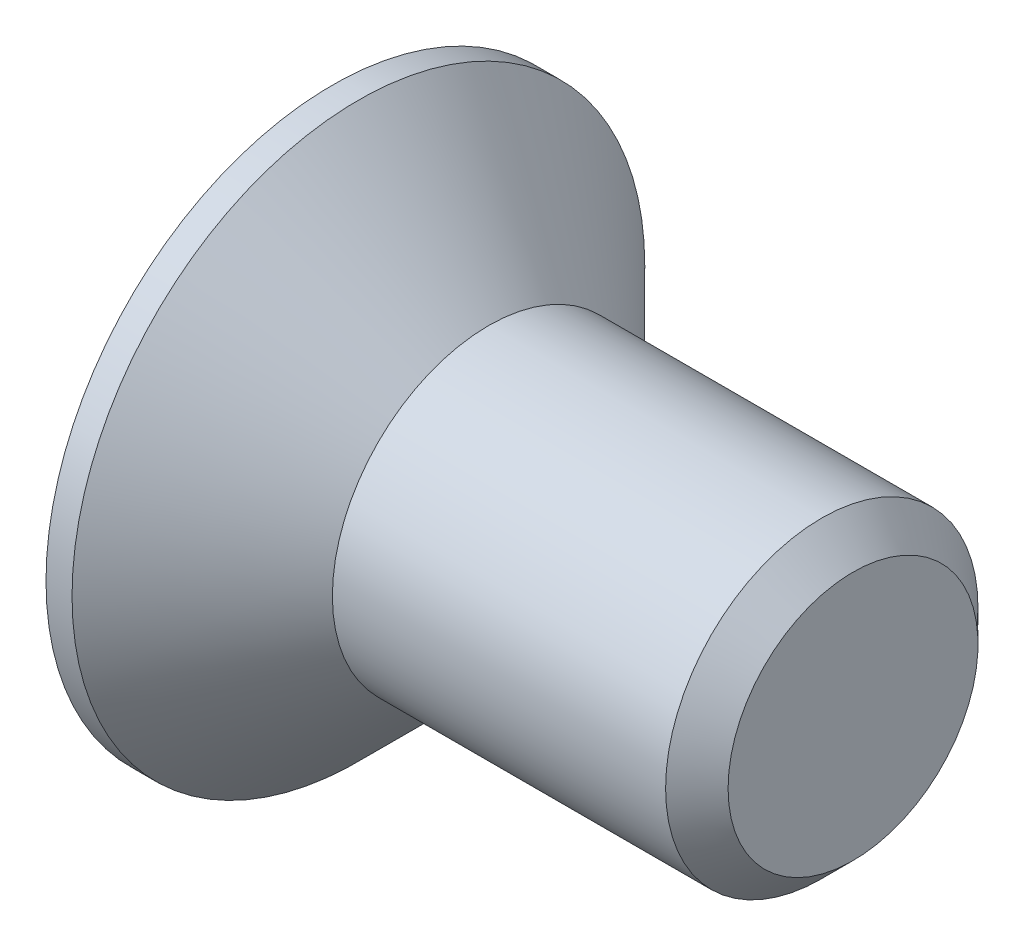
ISO-10303-21;
HEADER;
FILE_DESCRIPTION(('STEP AP214'),'2;1');
FILE_NAME('part.step','',(''),(''),'','','');
FILE_SCHEMA(('AUTOMOTIVE_DESIGN { 1 0 10303 214 1 1 1 1 }'));
ENDSEC;
DATA;
#1=APPLICATION_CONTEXT('core data for automotive mechanical design processes');
#2=APPLICATION_PROTOCOL_DEFINITION('international standard','automotive_design',2000,#1);
#3=PRODUCT_CONTEXT('',#1,'mechanical');
#4=PRODUCT('Part','Part','',(#3));
#5=PRODUCT_RELATED_PRODUCT_CATEGORY('part','',(#4));
#6=PRODUCT_DEFINITION_FORMATION('','',#4);
#7=PRODUCT_DEFINITION_CONTEXT('part definition',#1,'design');
#8=PRODUCT_DEFINITION('design','',#6,#7);
#9=PRODUCT_DEFINITION_SHAPE('','',#8);
#10=(LENGTH_UNIT() NAMED_UNIT(*) SI_UNIT(.MILLI.,.METRE.));
#11=(NAMED_UNIT(*) PLANE_ANGLE_UNIT() SI_UNIT($,.RADIAN.));
#12=(NAMED_UNIT(*) SI_UNIT($,.STERADIAN.) SOLID_ANGLE_UNIT());
#13=UNCERTAINTY_MEASURE_WITH_UNIT(LENGTH_MEASURE(1.E-05),#10,'distance_accuracy_value','');
#14=(GEOMETRIC_REPRESENTATION_CONTEXT(3) GLOBAL_UNCERTAINTY_ASSIGNED_CONTEXT((#13)) GLOBAL_UNIT_ASSIGNED_CONTEXT((#10,
#11,#12)) REPRESENTATION_CONTEXT('',''));
#15=CARTESIAN_POINT('',(0.,0.,0.));
#16=DIRECTION('',(0.,0.,1.));
#17=DIRECTION('',(1.,0.,0.));
#18=AXIS2_PLACEMENT_3D('',#15,#16,#17);
#19=CARTESIAN_POINT('',(0.,0.,0.));
#20=DIRECTION('',(-1.,0.,0.));
#21=DIRECTION('',(0.,0.,1.));
#22=AXIS2_PLACEMENT_3D('',#19,#20,#21);
#23=CONICAL_SURFACE('',#22,3.,0.78539816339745);
#24=CARTESIAN_POINT('',(-2.49999999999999,0.,0.));
#25=DIRECTION('',(-1.,0.,0.));
#26=DIRECTION('',(0.,0.,1.));
#27=AXIS2_PLACEMENT_3D('',#24,#25,#26);
#28=CIRCLE('',#27,5.5);
#29=CARTESIAN_POINT('',(-2.49999999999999,0.,5.5));
#30=VERTEX_POINT('',#29);
#31=EDGE_CURVE('E189',#30,#30,#28,.T.);
#32=ORIENTED_EDGE('',*,*,#31,.F.);
#33=EDGE_LOOP('',(#32));
#34=FACE_BOUND('',#33,.T.);
#35=CARTESIAN_POINT('',(0.,0.,0.));
#36=DIRECTION('',(-1.,0.,0.));
#37=DIRECTION('',(0.,0.,1.));
#38=AXIS2_PLACEMENT_3D('',#35,#36,#37);
#39=CIRCLE('',#38,3.);
#40=CARTESIAN_POINT('',(0.,0.,3.));
#41=VERTEX_POINT('',#40);
#42=EDGE_CURVE('E212',#41,#41,#39,.T.);
#43=ORIENTED_EDGE('',*,*,#42,.T.);
#44=EDGE_LOOP('',(#43));
#45=FACE_BOUND('',#44,.T.);
#46=ADVANCED_FACE('F33',(#34,#45),#23,.T.);
#47=CARTESIAN_POINT('',(-3.,0.,0.));
#48=DIRECTION('',(-1.,0.,0.));
#49=DIRECTION('',(0.,0.,1.));
#50=AXIS2_PLACEMENT_3D('',#47,#48,#49);
#51=CYLINDRICAL_SURFACE('',#50,3.);
#52=CARTESIAN_POINT('',(6.4,0.,0.));
#53=DIRECTION('',(-1.,0.,0.));
#54=DIRECTION('',(0.,0.,1.));
#55=AXIS2_PLACEMENT_3D('',#52,#53,#54);
#56=CIRCLE('',#55,3.);
#57=CARTESIAN_POINT('',(6.4,0.,3.));
#58=VERTEX_POINT('',#57);
#59=EDGE_CURVE('E41',#58,#58,#56,.T.);
#60=ORIENTED_EDGE('',*,*,#59,.T.);
#61=EDGE_LOOP('',(#60));
#62=FACE_BOUND('',#61,.T.);
#63=ORIENTED_EDGE('',*,*,#42,.F.);
#64=EDGE_LOOP('',(#63));
#65=FACE_BOUND('',#64,.T.);
#66=ADVANCED_FACE('F217',(#62,#65),#51,.T.);
#67=CARTESIAN_POINT('',(7.,0.,0.));
#68=DIRECTION('',(-1.,0.,0.));
#69=DIRECTION('',(0.,0.,1.));
#70=AXIS2_PLACEMENT_3D('',#67,#68,#69);
#71=PLANE('',#70);
#72=CARTESIAN_POINT('',(7.,0.,0.));
#73=DIRECTION('',(-1.,0.,0.));
#74=DIRECTION('',(0.,0.,1.));
#75=AXIS2_PLACEMENT_3D('',#72,#73,#74);
#76=CIRCLE('',#75,2.4);
#77=CARTESIAN_POINT('',(7.,0.,2.4));
#78=VERTEX_POINT('',#77);
#79=EDGE_CURVE('E11',#78,#78,#76,.F.);
#80=ORIENTED_EDGE('',*,*,#79,.T.);
#81=EDGE_LOOP('',(#80));
#82=FACE_BOUND('',#81,.T.);
#83=ADVANCED_FACE('F239',(#82),#71,.F.);
#84=CARTESIAN_POINT('',(-3.,5.5,0.));
#85=DIRECTION('',(1.,0.,0.));
#86=DIRECTION('',(0.,0.,-1.));
#87=AXIS2_PLACEMENT_3D('',#84,#85,#86);
#88=PLANE('',#87);
#89=DIRECTION('',(0.,0.,-1.));
#90=VECTOR('',#89,1.);
#91=CARTESIAN_POINT('',(-3.,0.825,-3.3));
#92=LINE('',#91,#90);
#93=CARTESIAN_POINT('',(-3.,0.825,-0.825));
#94=VERTEX_POINT('',#93);
#95=CARTESIAN_POINT('',(-3.,0.825,-3.3));
#96=VERTEX_POINT('',#95);
#97=EDGE_CURVE('E158',#94,#96,#92,.T.);
#98=ORIENTED_EDGE('',*,*,#97,.F.);
#99=DIRECTION('',(0.,-1.,0.));
#100=VECTOR('',#99,1.);
#101=CARTESIAN_POINT('',(-3.,0.825,-0.825));
#102=LINE('',#101,#100);
#103=CARTESIAN_POINT('',(-3.,3.3,-0.825));
#104=VERTEX_POINT('',#103);
#105=EDGE_CURVE('E48',#104,#94,#102,.T.);
#106=ORIENTED_EDGE('',*,*,#105,.F.);
#107=DIRECTION('',(0.,0.,-1.));
#108=VECTOR('',#107,1.);
#109=CARTESIAN_POINT('',(-3.,3.3,-0.825));
#110=LINE('',#109,#108);
#111=CARTESIAN_POINT('',(-3.,3.3,0.825));
#112=VERTEX_POINT('',#111);
#113=EDGE_CURVE('E185',#112,#104,#110,.T.);
#114=ORIENTED_EDGE('',*,*,#113,.F.);
#115=DIRECTION('',(0.,1.,0.));
#116=VECTOR('',#115,1.);
#117=CARTESIAN_POINT('',(-3.,3.3,0.825));
#118=LINE('',#117,#116);
#119=CARTESIAN_POINT('',(-3.,0.825,0.825));
#120=VERTEX_POINT('',#119);
#121=EDGE_CURVE('E183',#120,#112,#118,.T.);
#122=ORIENTED_EDGE('',*,*,#121,.F.);
#123=DIRECTION('',(0.,0.,-1.));
#124=VECTOR('',#123,1.);
#125=CARTESIAN_POINT('',(-3.,0.825,0.825));
#126=LINE('',#125,#124);
#127=CARTESIAN_POINT('',(-3.,0.825,3.3));
#128=VERTEX_POINT('',#127);
#129=EDGE_CURVE('E132',#128,#120,#126,.T.);
#130=ORIENTED_EDGE('',*,*,#129,.F.);
#131=DIRECTION('',(0.,1.,0.));
#132=VECTOR('',#131,1.);
#133=CARTESIAN_POINT('',(-3.,0.825,3.3));
#134=LINE('',#133,#132);
#135=CARTESIAN_POINT('',(-3.,-0.825,3.3));
#136=VERTEX_POINT('',#135);
#137=EDGE_CURVE('E179',#136,#128,#134,.T.);
#138=ORIENTED_EDGE('',*,*,#137,.F.);
#139=DIRECTION('',(0.,0.,1.));
#140=VECTOR('',#139,1.);
#141=CARTESIAN_POINT('',(-3.,-0.825,3.3));
#142=LINE('',#141,#140);
#143=CARTESIAN_POINT('',(-3.,-0.825,0.825));
#144=VERTEX_POINT('',#143);
#145=EDGE_CURVE('E176',#144,#136,#142,.T.);
#146=ORIENTED_EDGE('',*,*,#145,.F.);
#147=DIRECTION('',(0.,1.,0.));
#148=VECTOR('',#147,1.);
#149=CARTESIAN_POINT('',(-3.,-0.825,0.825));
#150=LINE('',#149,#148);
#151=CARTESIAN_POINT('',(-3.,-3.3,0.825));
#152=VERTEX_POINT('',#151);
#153=EDGE_CURVE('E173',#152,#144,#150,.T.);
#154=ORIENTED_EDGE('',*,*,#153,.F.);
#155=DIRECTION('',(0.,0.,1.));
#156=VECTOR('',#155,1.);
#157=CARTESIAN_POINT('',(-3.,-3.3,0.825));
#158=LINE('',#157,#156);
#159=CARTESIAN_POINT('',(-3.,-3.3,-0.825));
#160=VERTEX_POINT('',#159);
#161=EDGE_CURVE('E170',#160,#152,#158,.T.);
#162=ORIENTED_EDGE('',*,*,#161,.F.);
#163=DIRECTION('',(0.,-1.,0.));
#164=VECTOR('',#163,1.);
#165=CARTESIAN_POINT('',(-3.,-3.3,-0.825));
#166=LINE('',#165,#164);
#167=CARTESIAN_POINT('',(-3.,-0.825,-0.825));
#168=VERTEX_POINT('',#167);
#169=EDGE_CURVE('E167',#168,#160,#166,.T.);
#170=ORIENTED_EDGE('',*,*,#169,.F.);
#171=DIRECTION('',(0.,0.,1.));
#172=VECTOR('',#171,1.);
#173=CARTESIAN_POINT('',(-3.,-0.825,-0.825));
#174=LINE('',#173,#172);
#175=CARTESIAN_POINT('',(-3.,-0.825,-3.3));
#176=VERTEX_POINT('',#175);
#177=EDGE_CURVE('E164',#176,#168,#174,.T.);
#178=ORIENTED_EDGE('',*,*,#177,.F.);
#179=DIRECTION('',(0.,-1.,0.));
#180=VECTOR('',#179,1.);
#181=CARTESIAN_POINT('',(-3.,-0.825,-3.3));
#182=LINE('',#181,#180);
#183=EDGE_CURVE('E161',#96,#176,#182,.T.);
#184=ORIENTED_EDGE('',*,*,#183,.F.);
#185=EDGE_LOOP('',(#98,#106,#114,#122,#130,#138,#146,#154,#162,#170,#178,#184));
#186=FACE_BOUND('',#185,.T.);
#187=CARTESIAN_POINT('',(-3.,0.,0.));
#188=DIRECTION('',(-1.,0.,0.));
#189=DIRECTION('',(0.,0.,1.));
#190=AXIS2_PLACEMENT_3D('',#187,#188,#189);
#191=CIRCLE('',#190,5.5);
#192=CARTESIAN_POINT('',(-3.,0.,5.5));
#193=VERTEX_POINT('',#192);
#194=EDGE_CURVE('E209',#193,#193,#191,.T.);
#195=ORIENTED_EDGE('',*,*,#194,.T.);
#196=EDGE_LOOP('',(#195));
#197=FACE_BOUND('',#196,.T.);
#198=ADVANCED_FACE('F230',(#186,#197),#88,.F.);
#199=CARTESIAN_POINT('',(-3.,0.,0.));
#200=DIRECTION('',(-1.,0.,0.));
#201=DIRECTION('',(0.,0.,1.));
#202=AXIS2_PLACEMENT_3D('',#199,#200,#201);
#203=CYLINDRICAL_SURFACE('',#202,5.5);
#204=ORIENTED_EDGE('',*,*,#194,.F.);
#205=EDGE_LOOP('',(#204));
#206=FACE_BOUND('',#205,.T.);
#207=ORIENTED_EDGE('',*,*,#31,.T.);
#208=EDGE_LOOP('',(#207));
#209=FACE_BOUND('',#208,.T.);
#210=ADVANCED_FACE('F222',(#206,#209),#203,.T.);
#211=CARTESIAN_POINT('',(6.4,0.,0.));
#212=DIRECTION('',(-1.,0.,0.));
#213=DIRECTION('',(0.,0.,1.));
#214=AXIS2_PLACEMENT_3D('',#211,#212,#213);
#215=CONICAL_SURFACE('',#214,3.,0.785398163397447);
#216=ORIENTED_EDGE('',*,*,#79,.F.);
#217=EDGE_LOOP('',(#216));
#218=FACE_BOUND('',#217,.T.);
#219=ORIENTED_EDGE('',*,*,#59,.F.);
#220=EDGE_LOOP('',(#219));
#221=FACE_BOUND('',#220,.T.);
#222=ADVANCED_FACE('F35',(#218,#221),#215,.T.);
#223=CARTESIAN_POINT('',(-0.5,0.825,-0.825));
#224=DIRECTION('',(0.,0.,-1.));
#225=DIRECTION('',(-1.,0.,0.));
#226=AXIS2_PLACEMENT_3D('',#223,#224,#225);
#227=PLANE('',#226);
#228=ORIENTED_EDGE('',*,*,#105,.T.);
#229=DIRECTION('',(-1.,0.,0.));
#230=VECTOR('',#229,1.);
#231=CARTESIAN_POINT('',(-0.5,0.825,-0.825));
#232=LINE('',#231,#230);
#233=CARTESIAN_POINT('',(-0.5,0.825,-0.825));
#234=VERTEX_POINT('',#233);
#235=EDGE_CURVE('E96',#234,#94,#232,.T.);
#236=ORIENTED_EDGE('',*,*,#235,.F.);
#237=DIRECTION('',(0.,-1.,0.));
#238=VECTOR('',#237,1.);
#239=CARTESIAN_POINT('',(-0.5,0.825,-0.825));
#240=LINE('',#239,#238);
#241=CARTESIAN_POINT('',(-0.5,3.3,-0.825));
#242=VERTEX_POINT('',#241);
#243=EDGE_CURVE('E187',#242,#234,#240,.T.);
#244=ORIENTED_EDGE('',*,*,#243,.F.);
#245=DIRECTION('',(-1.,0.,0.));
#246=VECTOR('',#245,1.);
#247=CARTESIAN_POINT('',(-0.5,3.3,-0.825));
#248=LINE('',#247,#246);
#249=EDGE_CURVE('E56',#242,#104,#248,.T.);
#250=ORIENTED_EDGE('',*,*,#249,.T.);
#251=EDGE_LOOP('',(#228,#236,#244,#250));
#252=FACE_BOUND('',#251,.T.);
#253=ADVANCED_FACE('F221',(#252),#227,.F.);
#254=CARTESIAN_POINT('',(-0.5,3.3,-0.825));
#255=DIRECTION('',(0.,1.,0.));
#256=DIRECTION('',(-1.,0.,0.));
#257=AXIS2_PLACEMENT_3D('',#254,#255,#256);
#258=PLANE('',#257);
#259=ORIENTED_EDGE('',*,*,#113,.T.);
#260=ORIENTED_EDGE('',*,*,#249,.F.);
#261=DIRECTION('',(0.,0.,-1.));
#262=VECTOR('',#261,1.);
#263=CARTESIAN_POINT('',(-0.5,3.3,-0.825));
#264=LINE('',#263,#262);
#265=CARTESIAN_POINT('',(-0.5,3.3,0.825));
#266=VERTEX_POINT('',#265);
#267=EDGE_CURVE('E144',#266,#242,#264,.T.);
#268=ORIENTED_EDGE('',*,*,#267,.F.);
#269=DIRECTION('',(-1.,0.,0.));
#270=VECTOR('',#269,1.);
#271=CARTESIAN_POINT('',(-0.5,3.3,0.825));
#272=LINE('',#271,#270);
#273=EDGE_CURVE('E136',#266,#112,#272,.T.);
#274=ORIENTED_EDGE('',*,*,#273,.T.);
#275=EDGE_LOOP('',(#259,#260,#268,#274));
#276=FACE_BOUND('',#275,.T.);
#277=ADVANCED_FACE('F228',(#276),#258,.F.);
#278=CARTESIAN_POINT('',(-0.5,3.3,0.825));
#279=DIRECTION('',(0.,0.,1.));
#280=DIRECTION('',(1.,0.,0.));
#281=AXIS2_PLACEMENT_3D('',#278,#279,#280);
#282=PLANE('',#281);
#283=ORIENTED_EDGE('',*,*,#121,.T.);
#284=ORIENTED_EDGE('',*,*,#273,.F.);
#285=DIRECTION('',(0.,1.,0.));
#286=VECTOR('',#285,1.);
#287=CARTESIAN_POINT('',(-0.5,3.3,0.825));
#288=LINE('',#287,#286);
#289=CARTESIAN_POINT('',(-0.5,0.825,0.825));
#290=VERTEX_POINT('',#289);
#291=EDGE_CURVE('E140',#290,#266,#288,.T.);
#292=ORIENTED_EDGE('',*,*,#291,.F.);
#293=DIRECTION('',(-1.,0.,0.));
#294=VECTOR('',#293,1.);
#295=CARTESIAN_POINT('',(-0.5,0.825,0.825));
#296=LINE('',#295,#294);
#297=EDGE_CURVE('E125',#290,#120,#296,.T.);
#298=ORIENTED_EDGE('',*,*,#297,.T.);
#299=EDGE_LOOP('',(#283,#284,#292,#298));
#300=FACE_BOUND('',#299,.T.);
#301=ADVANCED_FACE('F141',(#300),#282,.F.);
#302=CARTESIAN_POINT('',(-0.5,0.825,0.825));
#303=DIRECTION('',(0.,1.,0.));
#304=DIRECTION('',(-1.,0.,0.));
#305=AXIS2_PLACEMENT_3D('',#302,#303,#304);
#306=PLANE('',#305);
#307=ORIENTED_EDGE('',*,*,#129,.T.);
#308=ORIENTED_EDGE('',*,*,#297,.F.);
#309=DIRECTION('',(0.,0.,-1.));
#310=VECTOR('',#309,1.);
#311=CARTESIAN_POINT('',(-0.5,0.825,0.825));
#312=LINE('',#311,#310);
#313=CARTESIAN_POINT('',(-0.5,0.825,3.3));
#314=VERTEX_POINT('',#313);
#315=EDGE_CURVE('E129',#314,#290,#312,.T.);
#316=ORIENTED_EDGE('',*,*,#315,.F.);
#317=DIRECTION('',(-1.,0.,0.));
#318=VECTOR('',#317,1.);
#319=CARTESIAN_POINT('',(-0.5,0.825,3.3));
#320=LINE('',#319,#318);
#321=EDGE_CURVE('E137',#314,#128,#320,.T.);
#322=ORIENTED_EDGE('',*,*,#321,.T.);
#323=EDGE_LOOP('',(#307,#308,#316,#322));
#324=FACE_BOUND('',#323,.T.);
#325=ADVANCED_FACE('F127',(#324),#306,.F.);
#326=CARTESIAN_POINT('',(-0.5,0.825,3.3));
#327=DIRECTION('',(0.,0.,1.));
#328=DIRECTION('',(1.,0.,0.));
#329=AXIS2_PLACEMENT_3D('',#326,#327,#328);
#330=PLANE('',#329);
#331=ORIENTED_EDGE('',*,*,#137,.T.);
#332=ORIENTED_EDGE('',*,*,#321,.F.);
#333=DIRECTION('',(0.,1.,0.));
#334=VECTOR('',#333,1.);
#335=CARTESIAN_POINT('',(-0.5,0.825,3.3));
#336=LINE('',#335,#334);
#337=CARTESIAN_POINT('',(-0.5,-0.825,3.3));
#338=VERTEX_POINT('',#337);
#339=EDGE_CURVE('E150',#338,#314,#336,.T.);
#340=ORIENTED_EDGE('',*,*,#339,.F.);
#341=DIRECTION('',(-1.,0.,0.));
#342=VECTOR('',#341,1.);
#343=CARTESIAN_POINT('',(-0.5,-0.825,3.3));
#344=LINE('',#343,#342);
#345=EDGE_CURVE('E192',#338,#136,#344,.T.);
#346=ORIENTED_EDGE('',*,*,#345,.T.);
#347=EDGE_LOOP('',(#331,#332,#340,#346));
#348=FACE_BOUND('',#347,.T.);
#349=ADVANCED_FACE('F277',(#348),#330,.F.);
#350=CARTESIAN_POINT('',(-0.5,-0.825,3.3));
#351=DIRECTION('',(0.,-1.,0.));
#352=DIRECTION('',(1.,0.,0.));
#353=AXIS2_PLACEMENT_3D('',#350,#351,#352);
#354=PLANE('',#353);
#355=ORIENTED_EDGE('',*,*,#145,.T.);
#356=ORIENTED_EDGE('',*,*,#345,.F.);
#357=DIRECTION('',(0.,0.,1.));
#358=VECTOR('',#357,1.);
#359=CARTESIAN_POINT('',(-0.5,-0.825,3.3));
#360=LINE('',#359,#358);
#361=CARTESIAN_POINT('',(-0.5,-0.825,0.825));
#362=VERTEX_POINT('',#361);
#363=EDGE_CURVE('E152',#362,#338,#360,.T.);
#364=ORIENTED_EDGE('',*,*,#363,.F.);
#365=DIRECTION('',(-1.,0.,0.));
#366=VECTOR('',#365,1.);
#367=CARTESIAN_POINT('',(-0.5,-0.825,0.825));
#368=LINE('',#367,#366);
#369=EDGE_CURVE('E194',#362,#144,#368,.T.);
#370=ORIENTED_EDGE('',*,*,#369,.T.);
#371=EDGE_LOOP('',(#355,#356,#364,#370));
#372=FACE_BOUND('',#371,.T.);
#373=ADVANCED_FACE('F273',(#372),#354,.F.);
#374=CARTESIAN_POINT('',(-0.5,-0.825,0.825));
#375=DIRECTION('',(0.,0.,1.));
#376=DIRECTION('',(1.,0.,0.));
#377=AXIS2_PLACEMENT_3D('',#374,#375,#376);
#378=PLANE('',#377);
#379=ORIENTED_EDGE('',*,*,#153,.T.);
#380=ORIENTED_EDGE('',*,*,#369,.F.);
#381=DIRECTION('',(0.,1.,0.));
#382=VECTOR('',#381,1.);
#383=CARTESIAN_POINT('',(-0.5,-0.825,0.825));
#384=LINE('',#383,#382);
#385=CARTESIAN_POINT('',(-0.5,-3.3,0.825));
#386=VERTEX_POINT('',#385);
#387=EDGE_CURVE('E422',#386,#362,#384,.T.);
#388=ORIENTED_EDGE('',*,*,#387,.F.);
#389=DIRECTION('',(-1.,0.,0.));
#390=VECTOR('',#389,1.);
#391=CARTESIAN_POINT('',(-0.5,-3.3,0.825));
#392=LINE('',#391,#390);
#393=EDGE_CURVE('E196',#386,#152,#392,.T.);
#394=ORIENTED_EDGE('',*,*,#393,.T.);
#395=EDGE_LOOP('',(#379,#380,#388,#394));
#396=FACE_BOUND('',#395,.T.);
#397=ADVANCED_FACE('F269',(#396),#378,.F.);
#398=CARTESIAN_POINT('',(-0.5,-3.3,0.825));
#399=DIRECTION('',(0.,-1.,0.));
#400=DIRECTION('',(1.,0.,0.));
#401=AXIS2_PLACEMENT_3D('',#398,#399,#400);
#402=PLANE('',#401);
#403=ORIENTED_EDGE('',*,*,#161,.T.);
#404=ORIENTED_EDGE('',*,*,#393,.F.);
#405=DIRECTION('',(0.,0.,1.));
#406=VECTOR('',#405,1.);
#407=CARTESIAN_POINT('',(-0.5,-3.3,0.825));
#408=LINE('',#407,#406);
#409=CARTESIAN_POINT('',(-0.5,-3.3,-0.825));
#410=VERTEX_POINT('',#409);
#411=EDGE_CURVE('E419',#410,#386,#408,.T.);
#412=ORIENTED_EDGE('',*,*,#411,.F.);
#413=DIRECTION('',(-1.,0.,0.));
#414=VECTOR('',#413,1.);
#415=CARTESIAN_POINT('',(-0.5,-3.3,-0.825));
#416=LINE('',#415,#414);
#417=EDGE_CURVE('E198',#410,#160,#416,.T.);
#418=ORIENTED_EDGE('',*,*,#417,.T.);
#419=EDGE_LOOP('',(#403,#404,#412,#418));
#420=FACE_BOUND('',#419,.T.);
#421=ADVANCED_FACE('F265',(#420),#402,.F.);
#422=CARTESIAN_POINT('',(-0.5,-3.3,-0.825));
#423=DIRECTION('',(0.,0.,-1.));
#424=DIRECTION('',(-1.,0.,0.));
#425=AXIS2_PLACEMENT_3D('',#422,#423,#424);
#426=PLANE('',#425);
#427=ORIENTED_EDGE('',*,*,#169,.T.);
#428=ORIENTED_EDGE('',*,*,#417,.F.);
#429=DIRECTION('',(0.,-1.,0.));
#430=VECTOR('',#429,1.);
#431=CARTESIAN_POINT('',(-0.5,-3.3,-0.825));
#432=LINE('',#431,#430);
#433=CARTESIAN_POINT('',(-0.5,-0.825,-0.825));
#434=VERTEX_POINT('',#433);
#435=EDGE_CURVE('E416',#434,#410,#432,.T.);
#436=ORIENTED_EDGE('',*,*,#435,.F.);
#437=DIRECTION('',(-1.,0.,0.));
#438=VECTOR('',#437,1.);
#439=CARTESIAN_POINT('',(-0.5,-0.825,-0.825));
#440=LINE('',#439,#438);
#441=EDGE_CURVE('E200',#434,#168,#440,.T.);
#442=ORIENTED_EDGE('',*,*,#441,.T.);
#443=EDGE_LOOP('',(#427,#428,#436,#442));
#444=FACE_BOUND('',#443,.T.);
#445=ADVANCED_FACE('F261',(#444),#426,.F.);
#446=CARTESIAN_POINT('',(-0.5,-0.825,-0.825));
#447=DIRECTION('',(0.,-1.,0.));
#448=DIRECTION('',(1.,0.,0.));
#449=AXIS2_PLACEMENT_3D('',#446,#447,#448);
#450=PLANE('',#449);
#451=ORIENTED_EDGE('',*,*,#177,.T.);
#452=ORIENTED_EDGE('',*,*,#441,.F.);
#453=DIRECTION('',(0.,0.,1.));
#454=VECTOR('',#453,1.);
#455=CARTESIAN_POINT('',(-0.5,-0.825,-0.825));
#456=LINE('',#455,#454);
#457=CARTESIAN_POINT('',(-0.5,-0.825,-3.3));
#458=VERTEX_POINT('',#457);
#459=EDGE_CURVE('E413',#458,#434,#456,.T.);
#460=ORIENTED_EDGE('',*,*,#459,.F.);
#461=DIRECTION('',(-1.,0.,0.));
#462=VECTOR('',#461,1.);
#463=CARTESIAN_POINT('',(-0.5,-0.825,-3.3));
#464=LINE('',#463,#462);
#465=EDGE_CURVE('E202',#458,#176,#464,.T.);
#466=ORIENTED_EDGE('',*,*,#465,.T.);
#467=EDGE_LOOP('',(#451,#452,#460,#466));
#468=FACE_BOUND('',#467,.T.);
#469=ADVANCED_FACE('F257',(#468),#450,.F.);
#470=CARTESIAN_POINT('',(-0.5,-0.825,-3.3));
#471=DIRECTION('',(0.,0.,-1.));
#472=DIRECTION('',(-1.,0.,0.));
#473=AXIS2_PLACEMENT_3D('',#470,#471,#472);
#474=PLANE('',#473);
#475=ORIENTED_EDGE('',*,*,#183,.T.);
#476=ORIENTED_EDGE('',*,*,#465,.F.);
#477=DIRECTION('',(0.,-1.,0.));
#478=VECTOR('',#477,1.);
#479=CARTESIAN_POINT('',(-0.5,-0.825,-3.3));
#480=LINE('',#479,#478);
#481=CARTESIAN_POINT('',(-0.5,0.825,-3.3));
#482=VERTEX_POINT('',#481);
#483=EDGE_CURVE('E408',#482,#458,#480,.T.);
#484=ORIENTED_EDGE('',*,*,#483,.F.);
#485=DIRECTION('',(-1.,0.,0.));
#486=VECTOR('',#485,1.);
#487=CARTESIAN_POINT('',(-0.5,0.825,-3.3));
#488=LINE('',#487,#486);
#489=EDGE_CURVE('E204',#482,#96,#488,.T.);
#490=ORIENTED_EDGE('',*,*,#489,.T.);
#491=EDGE_LOOP('',(#475,#476,#484,#490));
#492=FACE_BOUND('',#491,.T.);
#493=ADVANCED_FACE('F253',(#492),#474,.F.);
#494=CARTESIAN_POINT('',(-0.5,0.825,-3.3));
#495=DIRECTION('',(0.,1.,0.));
#496=DIRECTION('',(-1.,0.,0.));
#497=AXIS2_PLACEMENT_3D('',#494,#495,#496);
#498=PLANE('',#497);
#499=ORIENTED_EDGE('',*,*,#97,.T.);
#500=ORIENTED_EDGE('',*,*,#489,.F.);
#501=DIRECTION('',(0.,0.,-1.));
#502=VECTOR('',#501,1.);
#503=CARTESIAN_POINT('',(-0.5,0.825,-3.3));
#504=LINE('',#503,#502);
#505=EDGE_CURVE('E406',#234,#482,#504,.T.);
#506=ORIENTED_EDGE('',*,*,#505,.F.);
#507=ORIENTED_EDGE('',*,*,#235,.T.);
#508=EDGE_LOOP('',(#499,#500,#506,#507));
#509=FACE_BOUND('',#508,.T.);
#510=ADVANCED_FACE('F250',(#509),#498,.F.);
#511=CARTESIAN_POINT('',(-0.5,0.,0.));
#512=DIRECTION('',(1.,0.,0.));
#513=DIRECTION('',(0.,0.,-1.));
#514=AXIS2_PLACEMENT_3D('',#511,#512,#513);
#515=PLANE('',#514);
#516=ORIENTED_EDGE('',*,*,#243,.T.);
#517=ORIENTED_EDGE('',*,*,#505,.T.);
#518=ORIENTED_EDGE('',*,*,#483,.T.);
#519=ORIENTED_EDGE('',*,*,#459,.T.);
#520=ORIENTED_EDGE('',*,*,#435,.T.);
#521=ORIENTED_EDGE('',*,*,#411,.T.);
#522=ORIENTED_EDGE('',*,*,#387,.T.);
#523=ORIENTED_EDGE('',*,*,#363,.T.);
#524=ORIENTED_EDGE('',*,*,#339,.T.);
#525=ORIENTED_EDGE('',*,*,#315,.T.);
#526=ORIENTED_EDGE('',*,*,#291,.T.);
#527=ORIENTED_EDGE('',*,*,#267,.T.);
#528=EDGE_LOOP('',(#516,#517,#518,#519,#520,#521,#522,#523,#524,#525,#526,#527));
#529=FACE_BOUND('',#528,.T.);
#530=ADVANCED_FACE('F147',(#529),#515,.F.);
#531=CLOSED_SHELL('',(#46,#66,#83,#198,#210,#222,#253,#277,#301,#325,#349,#373,#397,#421,#445,
#469,#493,#510,#530));
#532=MANIFOLD_SOLID_BREP('B2',#531);
#533=ADVANCED_BREP_SHAPE_REPRESENTATION('',(#18,#532),#14);
#534=SHAPE_DEFINITION_REPRESENTATION(#9,#533);
ENDSEC;
END-ISO-10303-21;
